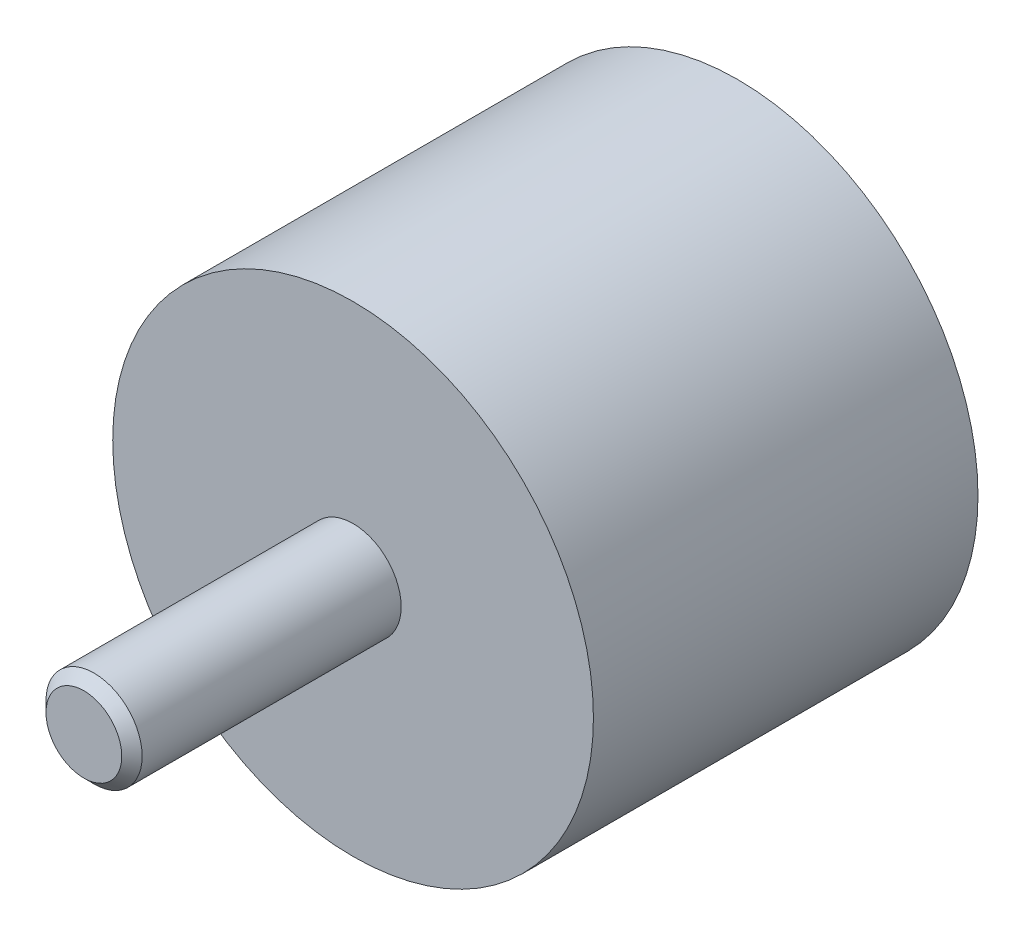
ISO-10303-21;
HEADER;
FILE_DESCRIPTION(('STEP AP214'),'2;1');
FILE_NAME('part.step','',(''),(''),'','','');
FILE_SCHEMA(('AUTOMOTIVE_DESIGN { 1 0 10303 214 1 1 1 1 }'));
ENDSEC;
DATA;
#1=APPLICATION_CONTEXT('core data for automotive mechanical design processes');
#2=APPLICATION_PROTOCOL_DEFINITION('international standard','automotive_design',2000,#1);
#3=PRODUCT_CONTEXT('',#1,'mechanical');
#4=PRODUCT('Part','Part','',(#3));
#5=PRODUCT_RELATED_PRODUCT_CATEGORY('part','',(#4));
#6=PRODUCT_DEFINITION_FORMATION('','',#4);
#7=PRODUCT_DEFINITION_CONTEXT('part definition',#1,'design');
#8=PRODUCT_DEFINITION('design','',#6,#7);
#9=PRODUCT_DEFINITION_SHAPE('','',#8);
#10=(LENGTH_UNIT() NAMED_UNIT(*) SI_UNIT(.MILLI.,.METRE.));
#11=(NAMED_UNIT(*) PLANE_ANGLE_UNIT() SI_UNIT($,.RADIAN.));
#12=(NAMED_UNIT(*) SI_UNIT($,.STERADIAN.) SOLID_ANGLE_UNIT());
#13=UNCERTAINTY_MEASURE_WITH_UNIT(LENGTH_MEASURE(1.E-05),#10,'distance_accuracy_value','');
#14=(GEOMETRIC_REPRESENTATION_CONTEXT(3) GLOBAL_UNCERTAINTY_ASSIGNED_CONTEXT((#13)) GLOBAL_UNIT_ASSIGNED_CONTEXT((#10,
#11,#12)) REPRESENTATION_CONTEXT('',''));
#15=CARTESIAN_POINT('',(0.,0.,0.));
#16=DIRECTION('',(0.,0.,1.));
#17=DIRECTION('',(1.,0.,0.));
#18=AXIS2_PLACEMENT_3D('',#15,#16,#17);
#19=CARTESIAN_POINT('',(0.,0.,0.66666666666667));
#20=DIRECTION('',(0.,0.,1.));
#21=DIRECTION('',(0.,-1.,0.));
#22=AXIS2_PLACEMENT_3D('',#19,#20,#21);
#23=CYLINDRICAL_SURFACE('',#22,25.);
#24=CARTESIAN_POINT('',(0.,0.,0.));
#25=DIRECTION('',(0.,0.,1.));
#26=DIRECTION('',(0.,-1.,0.));
#27=AXIS2_PLACEMENT_3D('',#24,#25,#26);
#28=CIRCLE('',#27,25.);
#29=CARTESIAN_POINT('',(0.,-25.,0.));
#30=VERTEX_POINT('',#29);
#31=EDGE_CURVE('E27',#30,#30,#28,.T.);
#32=ORIENTED_EDGE('',*,*,#31,.T.);
#33=EDGE_LOOP('',(#32));
#34=FACE_BOUND('',#33,.T.);
#35=CARTESIAN_POINT('',(0.,0.,40.));
#36=DIRECTION('',(0.,0.,-1.));
#37=DIRECTION('',(-1.,0.,0.));
#38=AXIS2_PLACEMENT_3D('',#35,#36,#37);
#39=CIRCLE('',#38,25.);
#40=CARTESIAN_POINT('',(-25.,0.,40.));
#41=VERTEX_POINT('',#40);
#42=EDGE_CURVE('E35',#41,#41,#39,.T.);
#43=ORIENTED_EDGE('',*,*,#42,.T.);
#44=EDGE_LOOP('',(#43));
#45=FACE_BOUND('',#44,.T.);
#46=ADVANCED_FACE('F12',(#34,#45),#23,.T.);
#47=CARTESIAN_POINT('',(25.,0.,0.));
#48=DIRECTION('',(0.,0.,-1.));
#49=DIRECTION('',(0.,1.,0.));
#50=AXIS2_PLACEMENT_3D('',#47,#48,#49);
#51=PLANE('',#50);
#52=CARTESIAN_POINT('',(0.,0.,0.));
#53=DIRECTION('',(0.,0.,-1.));
#54=DIRECTION('',(0.,1.,0.));
#55=AXIS2_PLACEMENT_3D('',#52,#53,#54);
#56=CIRCLE('',#55,5.65);
#57=CARTESIAN_POINT('',(0.,5.65,0.));
#58=VERTEX_POINT('',#57);
#59=EDGE_CURVE('E19',#58,#58,#56,.F.);
#60=ORIENTED_EDGE('',*,*,#59,.T.);
#61=EDGE_LOOP('',(#60));
#62=FACE_BOUND('',#61,.T.);
#63=ORIENTED_EDGE('',*,*,#31,.F.);
#64=EDGE_LOOP('',(#63));
#65=FACE_BOUND('',#64,.T.);
#66=ADVANCED_FACE('F58',(#62,#65),#51,.T.);
#67=CARTESIAN_POINT('',(0.,0.,0.));
#68=DIRECTION('',(0.,0.,1.));
#69=DIRECTION('',(0.,-1.,0.));
#70=AXIS2_PLACEMENT_3D('',#67,#68,#69);
#71=CYLINDRICAL_SURFACE('',#70,5.);
#72=CARTESIAN_POINT('',(0.,0.,0.65));
#73=DIRECTION('',(0.,0.,-1.));
#74=DIRECTION('',(0.,1.,0.));
#75=AXIS2_PLACEMENT_3D('',#72,#73,#74);
#76=CIRCLE('',#75,5.);
#77=CARTESIAN_POINT('',(0.,5.,0.65));
#78=VERTEX_POINT('',#77);
#79=EDGE_CURVE('E23',#78,#78,#76,.T.);
#80=ORIENTED_EDGE('',*,*,#79,.T.);
#81=EDGE_LOOP('',(#80));
#82=FACE_BOUND('',#81,.T.);
#83=CARTESIAN_POINT('',(0.,0.,10.));
#84=DIRECTION('',(0.,0.,-1.));
#85=DIRECTION('',(0.,1.,0.));
#86=AXIS2_PLACEMENT_3D('',#83,#84,#85);
#87=CIRCLE('',#86,5.);
#88=CARTESIAN_POINT('',(0.,5.,10.));
#89=VERTEX_POINT('',#88);
#90=EDGE_CURVE('E32',#89,#89,#87,.T.);
#91=ORIENTED_EDGE('',*,*,#90,.F.);
#92=EDGE_LOOP('',(#91));
#93=FACE_BOUND('',#92,.T.);
#94=ADVANCED_FACE('F63',(#82,#93),#71,.F.);
#95=CARTESIAN_POINT('',(0.,0.,10.));
#96=DIRECTION('',(0.,0.,-1.));
#97=DIRECTION('',(0.,1.,0.));
#98=AXIS2_PLACEMENT_3D('',#95,#96,#97);
#99=PLANE('',#98);
#100=ORIENTED_EDGE('',*,*,#90,.T.);
#101=EDGE_LOOP('',(#100));
#102=FACE_BOUND('',#101,.T.);
#103=ADVANCED_FACE('F69',(#102),#99,.T.);
#104=CARTESIAN_POINT('',(0.,0.,0.65));
#105=DIRECTION('',(0.,0.,-1.));
#106=DIRECTION('',(0.,1.,0.));
#107=AXIS2_PLACEMENT_3D('',#104,#105,#106);
#108=CONICAL_SURFACE('',#107,5.,0.785398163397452);
#109=ORIENTED_EDGE('',*,*,#59,.F.);
#110=EDGE_LOOP('',(#109));
#111=FACE_BOUND('',#110,.T.);
#112=ORIENTED_EDGE('',*,*,#79,.F.);
#113=EDGE_LOOP('',(#112));
#114=FACE_BOUND('',#113,.T.);
#115=ADVANCED_FACE('F14',(#111,#114),#108,.F.);
#116=CARTESIAN_POINT('',(0.,25.,40.));
#117=DIRECTION('',(0.,0.,1.));
#118=DIRECTION('',(1.,0.,0.));
#119=AXIS2_PLACEMENT_3D('',#116,#117,#118);
#120=PLANE('',#119);
#121=CARTESIAN_POINT('',(0.,0.,40.));
#122=DIRECTION('',(0.,0.,1.));
#123=DIRECTION('',(1.,0.,0.));
#124=AXIS2_PLACEMENT_3D('',#121,#122,#123);
#125=CIRCLE('',#124,5.);
#126=CARTESIAN_POINT('',(5.,0.,40.));
#127=VERTEX_POINT('',#126);
#128=EDGE_CURVE('E8',#127,#127,#125,.F.);
#129=ORIENTED_EDGE('',*,*,#128,.T.);
#130=EDGE_LOOP('',(#129));
#131=FACE_BOUND('',#130,.T.);
#132=ORIENTED_EDGE('',*,*,#42,.F.);
#133=EDGE_LOOP('',(#132));
#134=FACE_BOUND('',#133,.T.);
#135=ADVANCED_FACE('F73',(#131,#134),#120,.T.);
#136=CARTESIAN_POINT('',(0.,0.,20.));
#137=DIRECTION('',(0.,0.,1.));
#138=DIRECTION('',(0.,-1.,0.));
#139=AXIS2_PLACEMENT_3D('',#136,#137,#138);
#140=CYLINDRICAL_SURFACE('',#139,5.);
#141=ORIENTED_EDGE('',*,*,#128,.F.);
#142=EDGE_LOOP('',(#141));
#143=FACE_BOUND('',#142,.T.);
#144=CARTESIAN_POINT('',(0.,0.,66.940261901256));
#145=DIRECTION('',(0.,0.,-1.));
#146=DIRECTION('',(-1.,0.,0.));
#147=AXIS2_PLACEMENT_3D('',#144,#145,#146);
#148=CIRCLE('',#147,5.);
#149=CARTESIAN_POINT('',(-5.,0.,66.940261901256));
#150=VERTEX_POINT('',#149);
#151=EDGE_CURVE('E38',#150,#150,#148,.T.);
#152=ORIENTED_EDGE('',*,*,#151,.T.);
#153=EDGE_LOOP('',(#152));
#154=FACE_BOUND('',#153,.T.);
#155=ADVANCED_FACE('F55',(#143,#154),#140,.T.);
#156=CARTESIAN_POINT('',(0.,0.,66.940261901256));
#157=DIRECTION('',(0.,0.,-1.));
#158=DIRECTION('',(-1.,0.,0.));
#159=AXIS2_PLACEMENT_3D('',#156,#157,#158);
#160=CONICAL_SURFACE('',#159,5.,0.785398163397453);
#161=CARTESIAN_POINT('',(0.,0.,68.));
#162=DIRECTION('',(0.,0.,-1.));
#163=DIRECTION('',(-1.,0.,0.));
#164=AXIS2_PLACEMENT_3D('',#161,#162,#163);
#165=CIRCLE('',#164,3.94026190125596);
#166=CARTESIAN_POINT('',(-3.94026190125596,0.,68.));
#167=VERTEX_POINT('',#166);
#168=EDGE_CURVE('E41',#167,#167,#165,.T.);
#169=ORIENTED_EDGE('',*,*,#168,.T.);
#170=EDGE_LOOP('',(#169));
#171=FACE_BOUND('',#170,.T.);
#172=ORIENTED_EDGE('',*,*,#151,.F.);
#173=EDGE_LOOP('',(#172));
#174=FACE_BOUND('',#173,.T.);
#175=ADVANCED_FACE('F45',(#171,#174),#160,.T.);
#176=CARTESIAN_POINT('',(0.,3.94026190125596,68.));
#177=DIRECTION('',(0.,0.,1.));
#178=DIRECTION('',(1.,0.,0.));
#179=AXIS2_PLACEMENT_3D('',#176,#177,#178);
#180=PLANE('',#179);
#181=ORIENTED_EDGE('',*,*,#168,.F.);
#182=EDGE_LOOP('',(#181));
#183=FACE_BOUND('',#182,.T.);
#184=ADVANCED_FACE('F48',(#183),#180,.T.);
#185=CLOSED_SHELL('',(#46,#66,#94,#103,#115,#135,#155,#175,#184));
#186=MANIFOLD_SOLID_BREP('B1',#185);
#187=ADVANCED_BREP_SHAPE_REPRESENTATION('',(#18,#186),#14);
#188=SHAPE_DEFINITION_REPRESENTATION(#9,#187);
ENDSEC;
END-ISO-10303-21;
